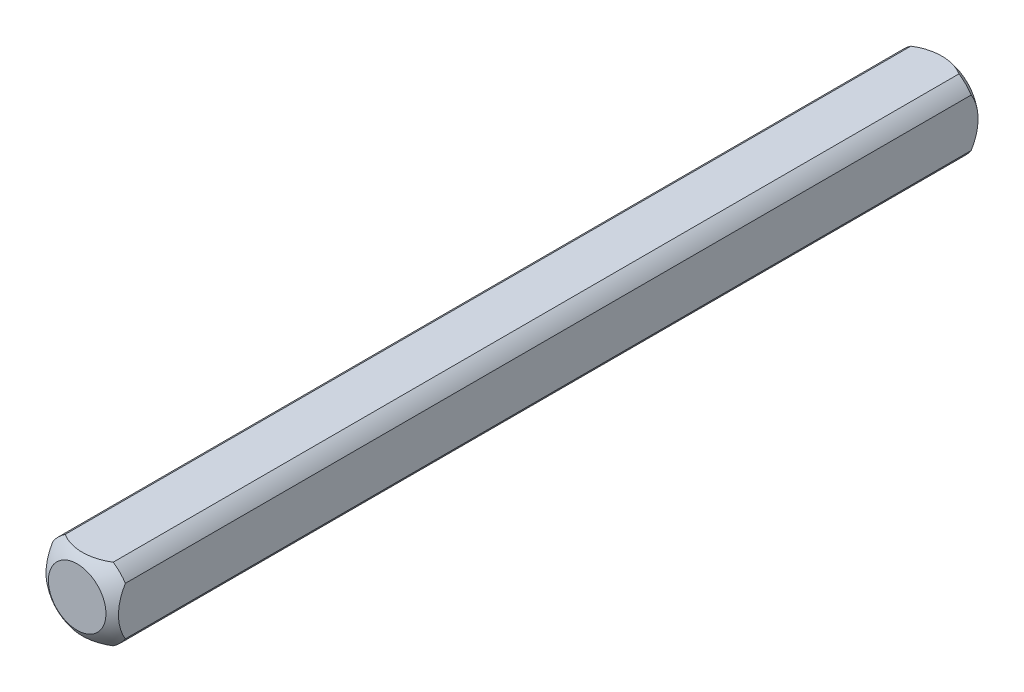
from build123d import *

# Parameters (mm, degrees)
SKETCH1_W           = 6.35
SKETCH1_H           = 6.35
BOSS_EXTRUDE1_DEPTH = 38.1
SKETCH2_OUTSIDE_W   = 16.178
SKETCH2_OUTSIDE_H   = 16.178
SKETCH2_OUTSIDE_R   = 3.81
CUT_EXTRUDE1_DEPTH  = 39.363670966


with BuildPart() as part:
    # Sketch1 → Boss-Extrude1 (new body)
    with BuildSketch(Plane.XY):
        Rectangle(SKETCH1_W, SKETCH1_H)
    extrude(amount=BOSS_EXTRUDE1_DEPTH)

    # Sketch2 outside → Cut-Extrude1 (cut, through all)
    with BuildSketch(Plane(origin=(0, 0, 0), x_dir=(-1, 0, 0), z_dir=(0, 0, -1))):
        Rectangle(SKETCH2_OUTSIDE_W, SKETCH2_OUTSIDE_H)
        Circle(SKETCH2_OUTSIDE_R, mode=Mode.SUBTRACT)
    extrude(amount=-CUT_EXTRUDE1_DEPTH, mode=Mode.SUBTRACT)

    # Sketch3 → Cut-Revolve1 (revolve, cut)
    with BuildSketch(Plane(origin=(0, 0, 0), x_dir=(1, 0, 0), z_dir=(0, 1, 0))):
        with BuildLine():
            Line((-5.053685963, -3.893335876), (-5.053685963, 5.740530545))
            Line((-5.053685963, 5.740530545), (0, 5.740530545))
            Line((0, 5.740530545), (0, 0.670274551))
            ThreePointArc((0, 0.670274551), (-3.404639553, -0.639469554), (-5.053685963, -3.893335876))
        make_face()
    revolve(axis=Axis((0, 0, 38.1), (0, 0, -1)), mode=Mode.SUBTRACT)

    # Mirror1: part across plane


with BuildPart() as part_1:
    add(part.part)
    add(part.part.mirror(Plane(origin=(0, 0, 38.1), x_dir=(1, 0, 0), z_dir=(0, 0, -1))))


solid = part_1.part
